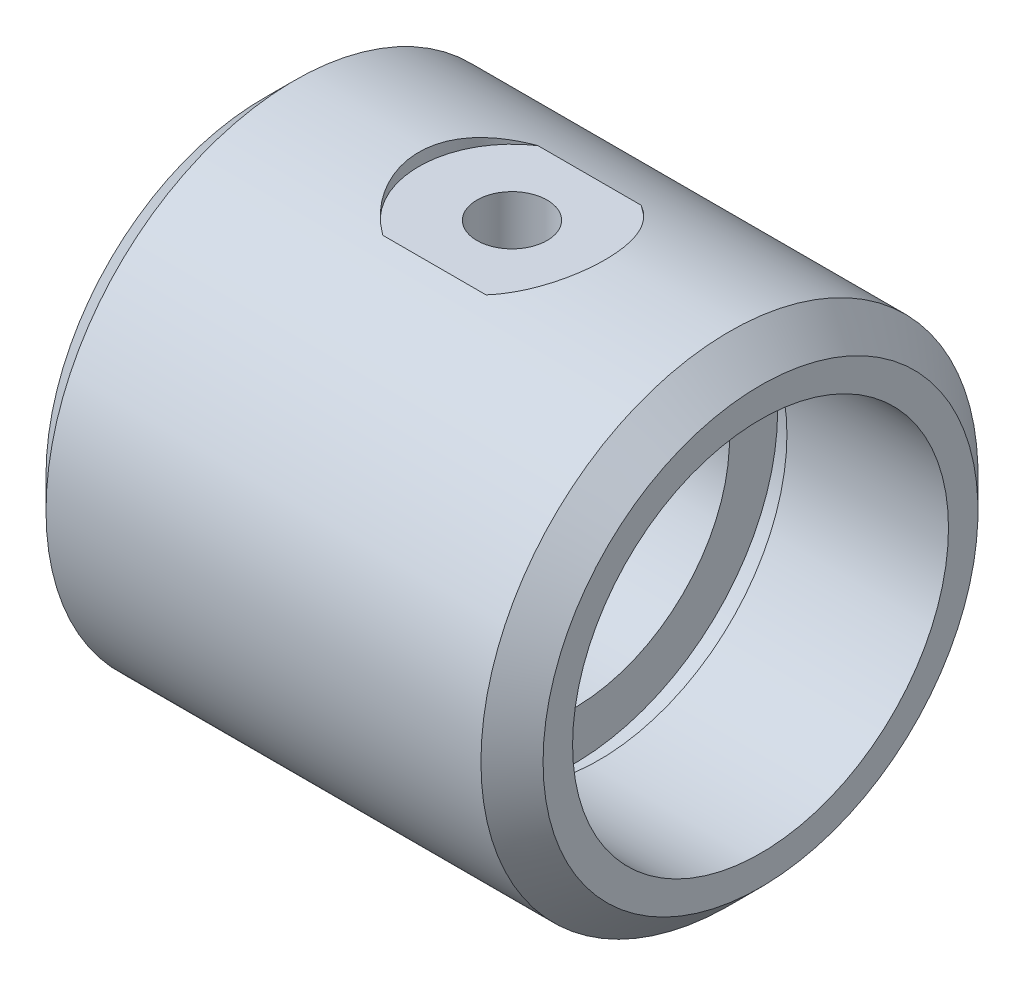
from build123d import *

# Parameters (mm, degrees)
F_43_0_089_DIAMETER_HOLE1_D     = 2.2606
F_43_0_089_DIAMETER_HOLE1_DEPTH = 5.08
F_43_0_089_DIAMETER_HOLE1_TIP   = 0.679152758
SKETCH4_R                       = 3
CUT_EXTRUDE1_DEPTH              = 0.4
SKETCH5_R                       = 6.55
SKETCH5_R_2                     = 6.05
CUT_EXTRUDE2_DEPTH              = 0.8
CUT_EXTRUDE3_START              = 0.8
SKETCH6_R                       = 6.55
SKETCH6_R_2                     = 6.05
CUT_EXTRUDE3_DEPTH              = 0.8


with BuildPart() as part:
    # Sketch1 → Revolve1 (revolve)
    with BuildSketch(Plane(origin=(0, 0, 0), x_dir=(1, 0, 0), z_dir=(0, 1, 0)), mode=Mode.PRIVATE) as revolve1_sk:
        Polygon((-2, 6.05), (-2, 5), (2, 5), (2, 6.05), (8, 6.05), (8, 7), (7, 8), (-7, 8), (-8, 7), (-8, 6.05), align=None)
    revolve(revolve1_sk.sketch.rotate(Axis((-15.811384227, 0, 0), (1, 0, 0)), 180), axis=Axis((-15.811384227, 0, 0), (1, 0, 0)))

    # 43 _0.089_ Diameter Hole1
    with Locations(Plane(origin=(0, 8, 0), x_dir=(-1, 0, 0), z_dir=(0, 1, 0))):
        with Locations((0, 0)):
            Hole(F_43_0_089_DIAMETER_HOLE1_D / 2, depth=F_43_0_089_DIAMETER_HOLE1_DEPTH)
            with Locations((0, 0, -(F_43_0_089_DIAMETER_HOLE1_DEPTH + F_43_0_089_DIAMETER_HOLE1_TIP / 2))):  # 118° drill point
                Cone(0, F_43_0_089_DIAMETER_HOLE1_D / 2, F_43_0_089_DIAMETER_HOLE1_TIP, mode=Mode.SUBTRACT)

    # Sketch4 → Cut-Extrude1 (cut)
    with BuildSketch(Plane(origin=(0, 8, 0), x_dir=(-1, 0, 0), z_dir=(0, 1, 0))):
        Circle(SKETCH4_R)
    extrude(amount=-CUT_EXTRUDE1_DEPTH, mode=Mode.SUBTRACT)

    # Sketch5 → Cut-Extrude2 (cut)
    with BuildSketch(Plane.ZY.offset(2)):
        Circle(SKETCH5_R)
        Circle(SKETCH5_R_2, mode=Mode.SUBTRACT)
    extrude(amount=CUT_EXTRUDE2_DEPTH, mode=Mode.SUBTRACT)

    # Sketch6 → Cut-Extrude3 (cut)
    with BuildSketch(Plane(origin=(2, 0, 0), x_dir=(0, 0, -1), z_dir=(1, 0, 0)).offset(CUT_EXTRUDE3_START)):
        with Locations(Location((0, 0, 0), (0, 0, 180))):
            Circle(SKETCH6_R)
        with Locations(Location((0, 0, 0), (0, 0, 180))):
            Circle(SKETCH6_R_2, mode=Mode.SUBTRACT)
    extrude(amount=-CUT_EXTRUDE3_DEPTH, mode=Mode.SUBTRACT)


solid = part.part
